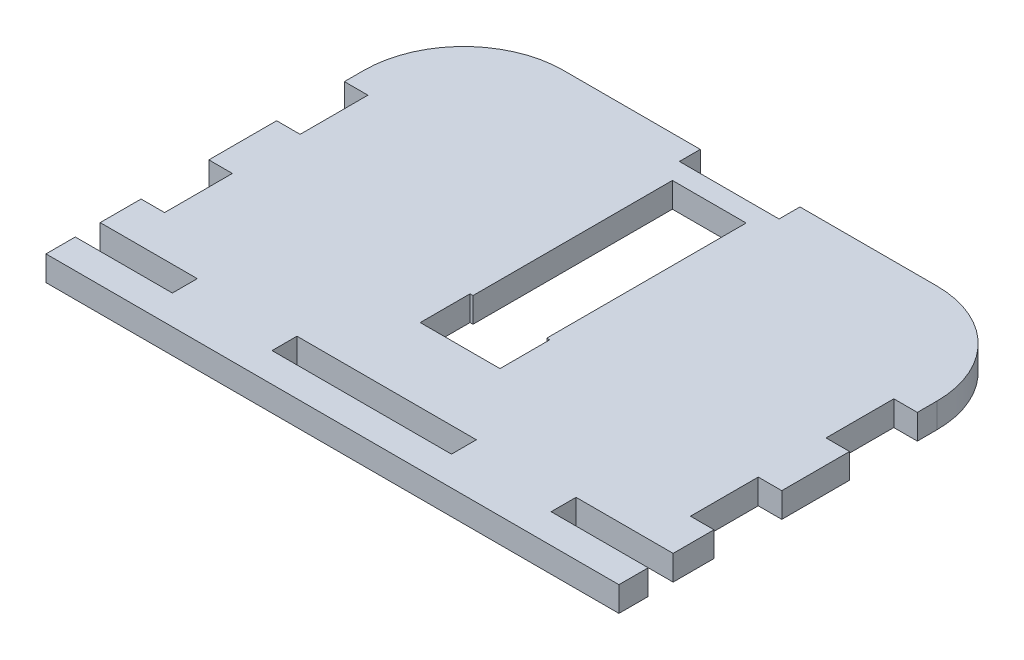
from build123d import *

# Parameters (mm, degrees)
SKETCH1_W      = 22.86
SKETCH1_H      = 3.175
EXTRUDE1_DEPTH = 3.175
SKETCH2_W      = 10.16
SKETCH2_H      = 6.346416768
EXTRUDE2_DEPTH = 51.31422158


with BuildPart() as part:
    # Sketch1 → Extrude1 (new body)
    with BuildSketch(Plane(origin=(0, 0, 0), x_dir=(1, 0, 0), z_dir=(0, 1, 0))):
        with BuildLine():
            Line((-36.5, 2.018), (-36.5, 10.654))
            Line((-36.5, 10.654), (-33.5028, 10.654))
            Line((-33.5028, 10.654), (-33.5028, 19.29))
            Line((-33.5028, 19.29), (-36.5, 19.29))
            Line((-36.5, 19.29), (-36.5, 21.784638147))
            ThreePointArc((-36.5, 21.784638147), (-32.780256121, 30.764894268), (-23.8, 34.484638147))
            Line((-23.8, 34.484638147), (-6.35, 34.484638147))
            Line((-6.35, 34.484638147), (-6.35, 31.821011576))
            Line((-6.35, 31.821011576), (0, 31.821011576))
            Line((0, 31.821011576), (6.35, 31.821011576))
            Line((6.35, 31.821011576), (6.35, 34.484638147))
            Line((6.35, 34.484638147), (23.8, 34.484638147))
            ThreePointArc((23.8, 34.484638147), (32.780256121, 30.764894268), (36.5, 21.784638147))
            Line((36.5, 21.784638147), (36.5, 19.29))
            Line((36.5, 19.29), (33.5028, 19.29))
            Line((33.5028, 19.29), (33.5028, 10.654))
            Line((33.5028, 10.654), (36.5, 10.654))
            Line((36.5, 10.654), (36.5, 2.018))
            Line((36.5, 2.018), (33.5028, 2.018))
            Line((33.5028, 2.018), (33.5028, -6.618))
            Line((33.5028, -6.618), (36.5, -6.618))
            Line((36.5, -6.618), (36.5, -11.825))
            Line((36.5, -11.825), (33.5028, -11.825))
            Line((33.5028, -11.825), (24.13, -11.825))
            Line((24.13, -11.825), (24.13, -15))
            Line((24.13, -15), (36.5, -15))
            Line((36.5, -15), (36.5, -18.730914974))
            Line((36.5, -18.730914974), (-36.5, -18.730914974))
            Line((-36.5, -18.730914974), (-36.5, -15))
            Line((-36.5, -15), (-24.13, -15))
            Line((-24.13, -15), (-24.13, -11.825))
            Line((-24.13, -11.825), (-33.5028, -11.825))
            Line((-33.5028, -11.825), (-36.5, -11.825))
            Line((-36.5, -11.825), (-36.5, -6.618))
            Line((-36.5, -6.618), (-33.5028, -6.618))
            Line((-33.5028, -6.618), (-33.5028, 2.018))
            Line((-33.5028, 2.018), (-36.5, 2.018))
        make_face()
        with Locations((0, -13.4125)):
            Rectangle(SKETCH1_W, SKETCH1_H, mode=Mode.SUBTRACT)
        Polygon((0, 29.281011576), (-4.699, 29.281011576), (-4.699, -2.468988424), (4.699, -2.468988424), (4.699, 29.281011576), align=None, mode=Mode.SUBTRACT)
    extrude(amount=EXTRUDE1_DEPTH)

    # Sketch2 → Extrude2 (cut, through all)
    with BuildSketch(Plane(origin=(0, 3.175, 0), x_dir=(1, 0, 0), z_dir=(0, 1, 0))):
        with Locations((0, 0.70421996)):
            Rectangle(SKETCH2_W, SKETCH2_H)
    extrude(amount=-EXTRUDE2_DEPTH, mode=Mode.SUBTRACT)


solid = part.part
